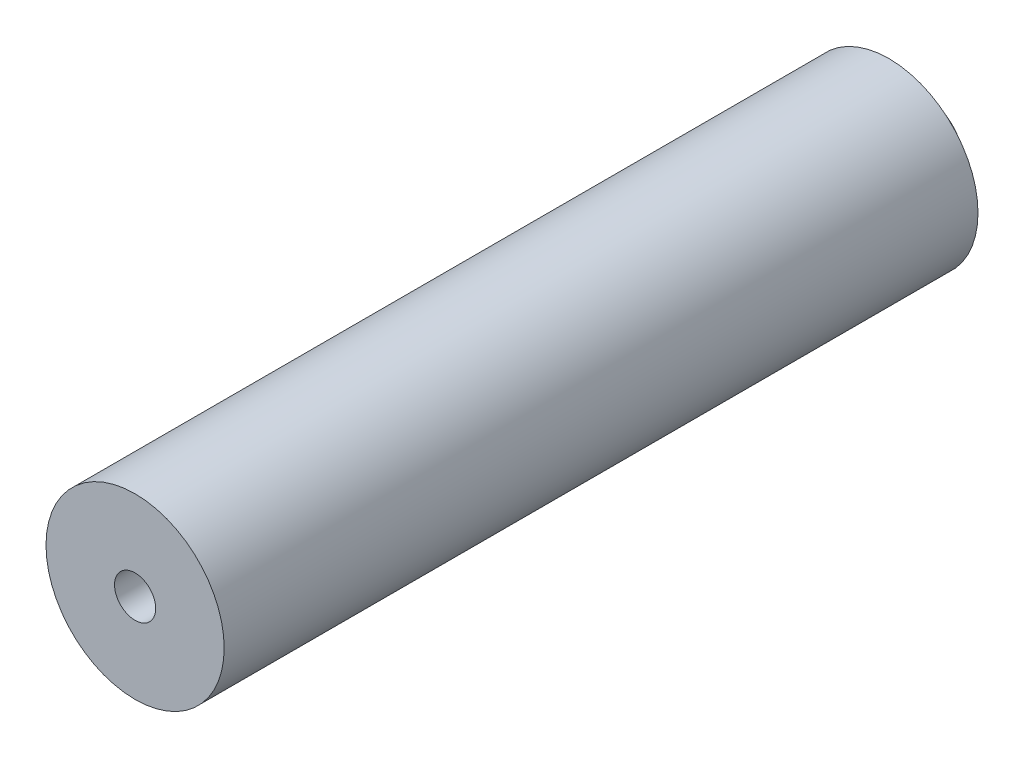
ISO-10303-21;
HEADER;
FILE_DESCRIPTION(('STEP AP214'),'2;1');
FILE_NAME('part.step','',(''),(''),'','','');
FILE_SCHEMA(('AUTOMOTIVE_DESIGN { 1 0 10303 214 1 1 1 1 }'));
ENDSEC;
DATA;
#1=APPLICATION_CONTEXT('core data for automotive mechanical design processes');
#2=APPLICATION_PROTOCOL_DEFINITION('international standard','automotive_design',2000,#1);
#3=PRODUCT_CONTEXT('',#1,'mechanical');
#4=PRODUCT('Part','Part','',(#3));
#5=PRODUCT_RELATED_PRODUCT_CATEGORY('part','',(#4));
#6=PRODUCT_DEFINITION_FORMATION('','',#4);
#7=PRODUCT_DEFINITION_CONTEXT('part definition',#1,'design');
#8=PRODUCT_DEFINITION('design','',#6,#7);
#9=PRODUCT_DEFINITION_SHAPE('','',#8);
#10=(LENGTH_UNIT() NAMED_UNIT(*) SI_UNIT(.MILLI.,.METRE.));
#11=(NAMED_UNIT(*) PLANE_ANGLE_UNIT() SI_UNIT($,.RADIAN.));
#12=(NAMED_UNIT(*) SI_UNIT($,.STERADIAN.) SOLID_ANGLE_UNIT());
#13=UNCERTAINTY_MEASURE_WITH_UNIT(LENGTH_MEASURE(1.E-05),#10,'distance_accuracy_value','');
#14=(GEOMETRIC_REPRESENTATION_CONTEXT(3) GLOBAL_UNCERTAINTY_ASSIGNED_CONTEXT((#13)) GLOBAL_UNIT_ASSIGNED_CONTEXT((#10,
#11,#12)) REPRESENTATION_CONTEXT('',''));
#15=CARTESIAN_POINT('',(0.,0.,0.));
#16=DIRECTION('',(0.,0.,1.));
#17=DIRECTION('',(1.,0.,0.));
#18=AXIS2_PLACEMENT_3D('',#15,#16,#17);
#19=CARTESIAN_POINT('',(0.,0.,0.));
#20=DIRECTION('',(0.,0.,1.));
#21=DIRECTION('',(1.,0.,0.));
#22=AXIS2_PLACEMENT_3D('',#19,#20,#21);
#23=PLANE('',#22);
#24=CARTESIAN_POINT('',(0.,0.,0.));
#25=DIRECTION('',(0.,0.,1.));
#26=DIRECTION('',(1.,0.,0.));
#27=AXIS2_PLACEMENT_3D('',#24,#25,#26);
#28=CIRCLE('',#27,6.5);
#29=CARTESIAN_POINT('',(6.5,0.,0.));
#30=VERTEX_POINT('',#29);
#31=EDGE_CURVE('E43',#30,#30,#28,.T.);
#32=ORIENTED_EDGE('',*,*,#31,.F.);
#33=EDGE_LOOP('',(#32));
#34=FACE_BOUND('',#33,.T.);
#35=CARTESIAN_POINT('',(0.,0.,0.));
#36=DIRECTION('',(0.,0.,1.));
#37=DIRECTION('',(1.,0.,0.));
#38=AXIS2_PLACEMENT_3D('',#35,#36,#37);
#39=CIRCLE('',#38,3.);
#40=CARTESIAN_POINT('',(3.,0.,0.));
#41=VERTEX_POINT('',#40);
#42=EDGE_CURVE('E10',#41,#41,#39,.F.);
#43=ORIENTED_EDGE('',*,*,#42,.F.);
#44=EDGE_LOOP('',(#43));
#45=FACE_BOUND('',#44,.T.);
#46=ADVANCED_FACE('F32',(#34,#45),#23,.F.);
#47=CARTESIAN_POINT('',(0.,0.,55.));
#48=DIRECTION('',(0.,0.,-1.));
#49=DIRECTION('',(-1.,0.,0.));
#50=AXIS2_PLACEMENT_3D('',#47,#48,#49);
#51=CYLINDRICAL_SURFACE('',#50,6.5);
#52=CARTESIAN_POINT('',(0.,0.,55.));
#53=DIRECTION('',(0.,0.,1.));
#54=DIRECTION('',(1.,0.,0.));
#55=AXIS2_PLACEMENT_3D('',#52,#53,#54);
#56=CIRCLE('',#55,6.5);
#57=CARTESIAN_POINT('',(6.5,0.,55.));
#58=VERTEX_POINT('',#57);
#59=EDGE_CURVE('E39',#58,#58,#56,.T.);
#60=ORIENTED_EDGE('',*,*,#59,.F.);
#61=EDGE_LOOP('',(#60));
#62=FACE_BOUND('',#61,.T.);
#63=ORIENTED_EDGE('',*,*,#31,.T.);
#64=EDGE_LOOP('',(#63));
#65=FACE_BOUND('',#64,.T.);
#66=ADVANCED_FACE('F34',(#62,#65),#51,.T.);
#67=CARTESIAN_POINT('',(0.,0.,55.));
#68=DIRECTION('',(0.,0.,1.));
#69=DIRECTION('',(1.,0.,0.));
#70=AXIS2_PLACEMENT_3D('',#67,#68,#69);
#71=PLANE('',#70);
#72=CARTESIAN_POINT('',(0.,0.,55.));
#73=DIRECTION('',(0.,0.,-1.));
#74=DIRECTION('',(-1.,0.,0.));
#75=AXIS2_PLACEMENT_3D('',#72,#73,#74);
#76=CIRCLE('',#75,1.5);
#77=CARTESIAN_POINT('',(-1.5,0.,55.));
#78=VERTEX_POINT('',#77);
#79=EDGE_CURVE('E52',#78,#78,#76,.T.);
#80=ORIENTED_EDGE('',*,*,#79,.T.);
#81=EDGE_LOOP('',(#80));
#82=FACE_BOUND('',#81,.T.);
#83=ORIENTED_EDGE('',*,*,#59,.T.);
#84=EDGE_LOOP('',(#83));
#85=FACE_BOUND('',#84,.T.);
#86=ADVANCED_FACE('F59',(#82,#85),#71,.T.);
#87=CARTESIAN_POINT('',(0.,0.,-2.5));
#88=DIRECTION('',(0.,0.,1.));
#89=DIRECTION('',(1.,0.,0.));
#90=AXIS2_PLACEMENT_3D('',#87,#88,#89);
#91=CYLINDRICAL_SURFACE('',#90,3.);
#92=CARTESIAN_POINT('',(0.,0.,-2.5));
#93=DIRECTION('',(0.,0.,-1.));
#94=DIRECTION('',(-1.,0.,0.));
#95=AXIS2_PLACEMENT_3D('',#92,#93,#94);
#96=CIRCLE('',#95,3.);
#97=CARTESIAN_POINT('',(-3.,0.,-2.5));
#98=VERTEX_POINT('',#97);
#99=EDGE_CURVE('E48',#98,#98,#96,.T.);
#100=ORIENTED_EDGE('',*,*,#99,.F.);
#101=EDGE_LOOP('',(#100));
#102=FACE_BOUND('',#101,.T.);
#103=ORIENTED_EDGE('',*,*,#42,.T.);
#104=EDGE_LOOP('',(#103));
#105=FACE_BOUND('',#104,.T.);
#106=ADVANCED_FACE('F70',(#102,#105),#91,.T.);
#107=CARTESIAN_POINT('',(0.,0.,-2.5));
#108=DIRECTION('',(0.,0.,-1.));
#109=DIRECTION('',(-1.,0.,0.));
#110=AXIS2_PLACEMENT_3D('',#107,#108,#109);
#111=PLANE('',#110);
#112=CARTESIAN_POINT('',(0.,0.,-2.5));
#113=DIRECTION('',(0.,0.,-1.));
#114=DIRECTION('',(-1.,0.,0.));
#115=AXIS2_PLACEMENT_3D('',#112,#113,#114);
#116=CIRCLE('',#115,1.5);
#117=CARTESIAN_POINT('',(-1.5,0.,-2.5));
#118=VERTEX_POINT('',#117);
#119=EDGE_CURVE('E53',#118,#118,#116,.T.);
#120=ORIENTED_EDGE('',*,*,#119,.F.);
#121=EDGE_LOOP('',(#120));
#122=FACE_BOUND('',#121,.T.);
#123=ORIENTED_EDGE('',*,*,#99,.T.);
#124=EDGE_LOOP('',(#123));
#125=FACE_BOUND('',#124,.T.);
#126=ADVANCED_FACE('F64',(#122,#125),#111,.T.);
#127=CARTESIAN_POINT('',(0.,0.,55.));
#128=DIRECTION('',(0.,0.,-1.));
#129=DIRECTION('',(-1.,0.,0.));
#130=AXIS2_PLACEMENT_3D('',#127,#128,#129);
#131=CYLINDRICAL_SURFACE('',#130,1.5);
#132=ORIENTED_EDGE('',*,*,#79,.F.);
#133=EDGE_LOOP('',(#132));
#134=FACE_BOUND('',#133,.T.);
#135=ORIENTED_EDGE('',*,*,#119,.T.);
#136=EDGE_LOOP('',(#135));
#137=FACE_BOUND('',#136,.T.);
#138=ADVANCED_FACE('F61',(#134,#137),#131,.F.);
#139=CLOSED_SHELL('',(#46,#66,#86,#106,#126,#138));
#140=MANIFOLD_SOLID_BREP('B2',#139);
#141=ADVANCED_BREP_SHAPE_REPRESENTATION('',(#18,#140),#14);
#142=SHAPE_DEFINITION_REPRESENTATION(#9,#141);
ENDSEC;
END-ISO-10303-21;
